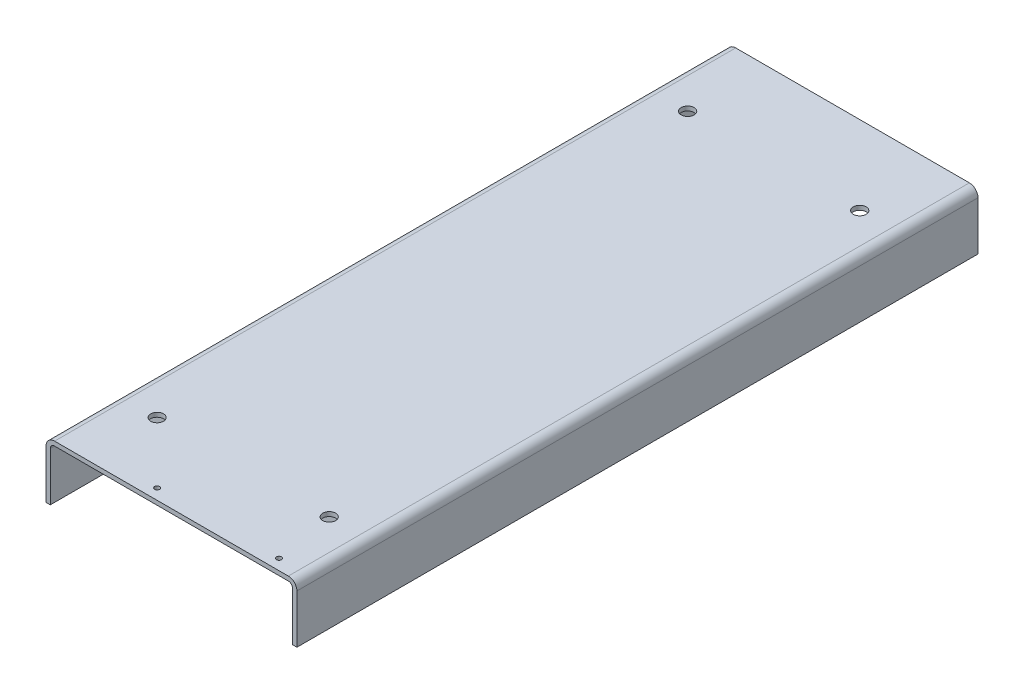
ISO-10303-21;
HEADER;
FILE_DESCRIPTION(('STEP AP214'),'2;1');
FILE_NAME('part.step','',(''),(''),'','','');
FILE_SCHEMA(('AUTOMOTIVE_DESIGN { 1 0 10303 214 1 1 1 1 }'));
ENDSEC;
DATA;
#1=APPLICATION_CONTEXT('core data for automotive mechanical design processes');
#2=APPLICATION_PROTOCOL_DEFINITION('international standard','automotive_design',2000,#1);
#3=PRODUCT_CONTEXT('',#1,'mechanical');
#4=PRODUCT('Part','Part','',(#3));
#5=PRODUCT_RELATED_PRODUCT_CATEGORY('part','',(#4));
#6=PRODUCT_DEFINITION_FORMATION('','',#4);
#7=PRODUCT_DEFINITION_CONTEXT('part definition',#1,'design');
#8=PRODUCT_DEFINITION('design','',#6,#7);
#9=PRODUCT_DEFINITION_SHAPE('','',#8);
#10=(LENGTH_UNIT() NAMED_UNIT(*) SI_UNIT(.MILLI.,.METRE.));
#11=(NAMED_UNIT(*) PLANE_ANGLE_UNIT() SI_UNIT($,.RADIAN.));
#12=(NAMED_UNIT(*) SI_UNIT($,.STERADIAN.) SOLID_ANGLE_UNIT());
#13=UNCERTAINTY_MEASURE_WITH_UNIT(LENGTH_MEASURE(1.E-05),#10,'distance_accuracy_value','');
#14=(GEOMETRIC_REPRESENTATION_CONTEXT(3) GLOBAL_UNCERTAINTY_ASSIGNED_CONTEXT((#13)) GLOBAL_UNIT_ASSIGNED_CONTEXT((#10,
#11,#12)) REPRESENTATION_CONTEXT('',''));
#15=CARTESIAN_POINT('',(0.,0.,0.));
#16=DIRECTION('',(0.,0.,1.));
#17=DIRECTION('',(1.,0.,0.));
#18=AXIS2_PLACEMENT_3D('',#15,#16,#17);
#19=CARTESIAN_POINT('',(-163.,74.,-950.));
#20=DIRECTION('',(0.,-1.,0.));
#21=DIRECTION('',(0.,0.,-1.));
#22=AXIS2_PLACEMENT_3D('',#19,#20,#21);
#23=PLANE('',#22);
#24=CARTESIAN_POINT('',(-120.,74.,-840.));
#25=DIRECTION('',(0.,1.,0.));
#26=DIRECTION('',(0.,0.,1.));
#27=AXIS2_PLACEMENT_3D('',#24,#25,#26);
#28=CIRCLE('',#27,9.00000000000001);
#29=CARTESIAN_POINT('',(-120.,74.,-831.));
#30=VERTEX_POINT('',#29);
#31=EDGE_CURVE('E352',#30,#30,#28,.T.);
#32=ORIENTED_EDGE('',*,*,#31,.T.);
#33=EDGE_LOOP('',(#32));
#34=FACE_BOUND('',#33,.T.);
#35=CARTESIAN_POINT('',(120.,74.,-840.));
#36=DIRECTION('',(0.,1.,0.));
#37=DIRECTION('',(0.,0.,1.));
#38=AXIS2_PLACEMENT_3D('',#35,#36,#37);
#39=CIRCLE('',#38,9.00000000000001);
#40=CARTESIAN_POINT('',(120.,74.,-831.));
#41=VERTEX_POINT('',#40);
#42=EDGE_CURVE('E358',#41,#41,#39,.T.);
#43=ORIENTED_EDGE('',*,*,#42,.T.);
#44=EDGE_LOOP('',(#43));
#45=FACE_BOUND('',#44,.T.);
#46=DIRECTION('',(0.,0.,1.));
#47=VECTOR('',#46,1.);
#48=CARTESIAN_POINT('',(163.,74.,-950.));
#49=LINE('',#48,#47);
#50=CARTESIAN_POINT('',(163.,74.,-950.));
#51=VERTEX_POINT('',#50);
#52=CARTESIAN_POINT('',(163.,74.,-813.));
#53=VERTEX_POINT('',#52);
#54=EDGE_CURVE('E532',#51,#53,#49,.T.);
#55=ORIENTED_EDGE('',*,*,#54,.T.);
#56=DIRECTION('',(-1.,0.,0.));
#57=VECTOR('',#56,1.);
#58=CARTESIAN_POINT('',(-163.,74.,-813.));
#59=LINE('',#58,#57);
#60=CARTESIAN_POINT('',(-163.,74.,-813.));
#61=VERTEX_POINT('',#60);
#62=EDGE_CURVE('E302',#53,#61,#59,.T.);
#63=ORIENTED_EDGE('',*,*,#62,.T.);
#64=DIRECTION('',(0.,0.,1.));
#65=VECTOR('',#64,1.);
#66=CARTESIAN_POINT('',(-163.,74.,-950.));
#67=LINE('',#66,#65);
#68=CARTESIAN_POINT('',(-163.,74.,-950.));
#69=VERTEX_POINT('',#68);
#70=EDGE_CURVE('E536',#69,#61,#67,.T.);
#71=ORIENTED_EDGE('',*,*,#70,.F.);
#72=DIRECTION('',(1.,0.,0.));
#73=VECTOR('',#72,1.);
#74=CARTESIAN_POINT('',(-163.,74.,-950.));
#75=LINE('',#74,#73);
#76=EDGE_CURVE('E492',#69,#51,#75,.T.);
#77=ORIENTED_EDGE('',*,*,#76,.T.);
#78=EDGE_LOOP('',(#55,#63,#71,#77));
#79=FACE_BOUND('',#78,.T.);
#80=ADVANCED_FACE('F32',(#34,#45,#79),#23,.T.);
#81=CARTESIAN_POINT('',(169.,68.,-950.));
#82=DIRECTION('',(-1.,0.,0.));
#83=DIRECTION('',(0.,0.,1.));
#84=AXIS2_PLACEMENT_3D('',#81,#82,#83);
#85=PLANE('',#84);
#86=DIRECTION('',(0.,0.,1.));
#87=VECTOR('',#86,1.);
#88=CARTESIAN_POINT('',(169.,0.,-950.));
#89=LINE('',#88,#87);
#90=CARTESIAN_POINT('',(169.,0.,-950.));
#91=VERTEX_POINT('',#90);
#92=CARTESIAN_POINT('',(169.,0.,-813.));
#93=VERTEX_POINT('',#92);
#94=EDGE_CURVE('E36',#91,#93,#89,.T.);
#95=ORIENTED_EDGE('',*,*,#94,.T.);
#96=DIRECTION('',(0.,1.,0.));
#97=VECTOR('',#96,1.);
#98=CARTESIAN_POINT('',(169.,68.,-813.));
#99=LINE('',#98,#97);
#100=CARTESIAN_POINT('',(169.,68.,-813.));
#101=VERTEX_POINT('',#100);
#102=EDGE_CURVE('E305',#93,#101,#99,.T.);
#103=ORIENTED_EDGE('',*,*,#102,.T.);
#104=DIRECTION('',(0.,0.,1.));
#105=VECTOR('',#104,1.);
#106=CARTESIAN_POINT('',(169.,68.,-950.));
#107=LINE('',#106,#105);
#108=CARTESIAN_POINT('',(169.,68.,-950.));
#109=VERTEX_POINT('',#108);
#110=EDGE_CURVE('E11',#109,#101,#107,.T.);
#111=ORIENTED_EDGE('',*,*,#110,.F.);
#112=DIRECTION('',(0.,1.,0.));
#113=VECTOR('',#112,1.);
#114=CARTESIAN_POINT('',(169.,68.,-950.));
#115=LINE('',#114,#113);
#116=EDGE_CURVE('E468',#109,#91,#115,.F.);
#117=ORIENTED_EDGE('',*,*,#116,.T.);
#118=EDGE_LOOP('',(#95,#103,#111,#117));
#119=FACE_BOUND('',#118,.T.);
#120=ADVANCED_FACE('F626',(#119),#85,.T.);
#121=CARTESIAN_POINT('',(163.,68.,-950.));
#122=DIRECTION('',(0.,0.,1.));
#123=DIRECTION('',(1.,0.,0.));
#124=AXIS2_PLACEMENT_3D('',#121,#122,#123);
#125=CYLINDRICAL_SURFACE('',#124,6.);
#126=ORIENTED_EDGE('',*,*,#110,.T.);
#127=CARTESIAN_POINT('',(163.,68.,-813.));
#128=DIRECTION('',(0.,0.,1.));
#129=DIRECTION('',(1.,0.,0.));
#130=AXIS2_PLACEMENT_3D('',#127,#128,#129);
#131=CIRCLE('',#130,6.);
#132=EDGE_CURVE('E57',#101,#53,#131,.T.);
#133=ORIENTED_EDGE('',*,*,#132,.T.);
#134=ORIENTED_EDGE('',*,*,#54,.F.);
#135=CARTESIAN_POINT('',(163.,68.,-950.));
#136=DIRECTION('',(0.,0.,1.));
#137=DIRECTION('',(1.,0.,0.));
#138=AXIS2_PLACEMENT_3D('',#135,#136,#137);
#139=CIRCLE('',#138,6.);
#140=EDGE_CURVE('E495',#51,#109,#139,.F.);
#141=ORIENTED_EDGE('',*,*,#140,.T.);
#142=EDGE_LOOP('',(#126,#133,#134,#141));
#143=FACE_BOUND('',#142,.T.);
#144=ADVANCED_FACE('F631',(#143),#125,.F.);
#145=CARTESIAN_POINT('',(-163.,68.,-950.));
#146=DIRECTION('',(0.,0.,1.));
#147=DIRECTION('',(1.,0.,0.));
#148=AXIS2_PLACEMENT_3D('',#145,#146,#147);
#149=CYLINDRICAL_SURFACE('',#148,5.99999999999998);
#150=ORIENTED_EDGE('',*,*,#70,.T.);
#151=CARTESIAN_POINT('',(-163.,68.,-813.));
#152=DIRECTION('',(0.,0.,1.));
#153=DIRECTION('',(1.,0.,0.));
#154=AXIS2_PLACEMENT_3D('',#151,#152,#153);
#155=CIRCLE('',#154,5.99999999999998);
#156=CARTESIAN_POINT('',(-169.,68.,-813.));
#157=VERTEX_POINT('',#156);
#158=EDGE_CURVE('E296',#61,#157,#155,.T.);
#159=ORIENTED_EDGE('',*,*,#158,.T.);
#160=DIRECTION('',(0.,0.,1.));
#161=VECTOR('',#160,1.);
#162=CARTESIAN_POINT('',(-169.,68.,-950.));
#163=LINE('',#162,#161);
#164=CARTESIAN_POINT('',(-169.,68.,-950.));
#165=VERTEX_POINT('',#164);
#166=EDGE_CURVE('E541',#165,#157,#163,.T.);
#167=ORIENTED_EDGE('',*,*,#166,.F.);
#168=CARTESIAN_POINT('',(-163.,68.,-950.));
#169=DIRECTION('',(0.,0.,1.));
#170=DIRECTION('',(1.,0.,0.));
#171=AXIS2_PLACEMENT_3D('',#168,#169,#170);
#172=CIRCLE('',#171,5.99999999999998);
#173=EDGE_CURVE('E489',#165,#69,#172,.F.);
#174=ORIENTED_EDGE('',*,*,#173,.T.);
#175=EDGE_LOOP('',(#150,#159,#167,#174));
#176=FACE_BOUND('',#175,.T.);
#177=ADVANCED_FACE('F620',(#176),#149,.F.);
#178=CARTESIAN_POINT('',(-169.,0.,-950.));
#179=DIRECTION('',(1.,0.,0.));
#180=DIRECTION('',(0.,1.,0.));
#181=AXIS2_PLACEMENT_3D('',#178,#179,#180);
#182=PLANE('',#181);
#183=ORIENTED_EDGE('',*,*,#166,.T.);
#184=DIRECTION('',(0.,-1.,0.));
#185=VECTOR('',#184,1.);
#186=CARTESIAN_POINT('',(-169.,0.,-813.));
#187=LINE('',#186,#185);
#188=CARTESIAN_POINT('',(-169.,0.,-813.));
#189=VERTEX_POINT('',#188);
#190=EDGE_CURVE('E293',#157,#189,#187,.T.);
#191=ORIENTED_EDGE('',*,*,#190,.T.);
#192=DIRECTION('',(0.,0.,1.));
#193=VECTOR('',#192,1.);
#194=CARTESIAN_POINT('',(-169.,0.,-950.));
#195=LINE('',#194,#193);
#196=CARTESIAN_POINT('',(-169.,0.,-950.));
#197=VERTEX_POINT('',#196);
#198=EDGE_CURVE('E546',#197,#189,#195,.T.);
#199=ORIENTED_EDGE('',*,*,#198,.F.);
#200=DIRECTION('',(0.,1.,0.));
#201=VECTOR('',#200,1.);
#202=CARTESIAN_POINT('',(-169.,0.,-950.));
#203=LINE('',#202,#201);
#204=EDGE_CURVE('E486',#197,#165,#203,.T.);
#205=ORIENTED_EDGE('',*,*,#204,.T.);
#206=EDGE_LOOP('',(#183,#191,#199,#205));
#207=FACE_BOUND('',#206,.T.);
#208=ADVANCED_FACE('F613',(#207),#182,.T.);
#209=DIRECTION('',(-1.,0.,0.));
#210=VECTOR('',#209,1.);
#211=CARTESIAN_POINT('',(-163.,74.,-807.));
#212=LINE('',#211,#210);
#213=CARTESIAN_POINT('',(163.,74.,-807.));
#214=VERTEX_POINT('',#213);
#215=CARTESIAN_POINT('',(-163.,74.,-807.));
#216=VERTEX_POINT('',#215);
#217=EDGE_CURVE('E50',#214,#216,#212,.T.);
#218=ORIENTED_EDGE('',*,*,#217,.F.);
#219=CARTESIAN_POINT('',(163.,74.,-143.));
#220=VERTEX_POINT('',#219);
#221=EDGE_CURVE('E534',#214,#220,#49,.T.);
#222=ORIENTED_EDGE('',*,*,#221,.T.);
#223=DIRECTION('',(-1.,0.,0.));
#224=VECTOR('',#223,1.);
#225=CARTESIAN_POINT('',(-163.,74.,-143.));
#226=LINE('',#225,#224);
#227=CARTESIAN_POINT('',(-163.,74.,-143.));
#228=VERTEX_POINT('',#227);
#229=EDGE_CURVE('E322',#220,#228,#226,.T.);
#230=ORIENTED_EDGE('',*,*,#229,.T.);
#231=EDGE_CURVE('E539',#216,#228,#67,.T.);
#232=ORIENTED_EDGE('',*,*,#231,.F.);
#233=EDGE_LOOP('',(#218,#222,#230,#232));
#234=FACE_BOUND('',#233,.T.);
#235=ADVANCED_FACE('F588',(#234),#23,.T.);
#236=DIRECTION('',(0.,1.,0.));
#237=VECTOR('',#236,1.);
#238=CARTESIAN_POINT('',(169.,68.,-807.));
#239=LINE('',#238,#237);
#240=CARTESIAN_POINT('',(169.,0.,-807.));
#241=VERTEX_POINT('',#240);
#242=CARTESIAN_POINT('',(169.,68.,-807.));
#243=VERTEX_POINT('',#242);
#244=EDGE_CURVE('E283',#241,#243,#239,.T.);
#245=ORIENTED_EDGE('',*,*,#244,.F.);
#246=CARTESIAN_POINT('',(169.,0.,-143.));
#247=VERTEX_POINT('',#246);
#248=EDGE_CURVE('E269',#241,#247,#89,.T.);
#249=ORIENTED_EDGE('',*,*,#248,.T.);
#250=DIRECTION('',(0.,1.,0.));
#251=VECTOR('',#250,1.);
#252=CARTESIAN_POINT('',(169.,68.,-143.));
#253=LINE('',#252,#251);
#254=CARTESIAN_POINT('',(169.,68.,-143.));
#255=VERTEX_POINT('',#254);
#256=EDGE_CURVE('E328',#247,#255,#253,.T.);
#257=ORIENTED_EDGE('',*,*,#256,.T.);
#258=EDGE_CURVE('E41',#243,#255,#107,.T.);
#259=ORIENTED_EDGE('',*,*,#258,.F.);
#260=EDGE_LOOP('',(#245,#249,#257,#259));
#261=FACE_BOUND('',#260,.T.);
#262=ADVANCED_FACE('F284',(#261),#85,.T.);
#263=CARTESIAN_POINT('',(163.,68.,-807.));
#264=DIRECTION('',(0.,0.,1.));
#265=DIRECTION('',(1.,0.,0.));
#266=AXIS2_PLACEMENT_3D('',#263,#264,#265);
#267=CIRCLE('',#266,6.);
#268=EDGE_CURVE('E287',#243,#214,#267,.T.);
#269=ORIENTED_EDGE('',*,*,#268,.F.);
#270=ORIENTED_EDGE('',*,*,#258,.T.);
#271=CARTESIAN_POINT('',(163.,68.,-143.));
#272=DIRECTION('',(0.,0.,1.));
#273=DIRECTION('',(1.,0.,0.));
#274=AXIS2_PLACEMENT_3D('',#271,#272,#273);
#275=CIRCLE('',#274,6.);
#276=EDGE_CURVE('E325',#255,#220,#275,.T.);
#277=ORIENTED_EDGE('',*,*,#276,.T.);
#278=ORIENTED_EDGE('',*,*,#221,.F.);
#279=EDGE_LOOP('',(#269,#270,#277,#278));
#280=FACE_BOUND('',#279,.T.);
#281=ADVANCED_FACE('F581',(#280),#125,.F.);
#282=CARTESIAN_POINT('',(-163.,68.,-807.));
#283=DIRECTION('',(0.,0.,1.));
#284=DIRECTION('',(1.,0.,0.));
#285=AXIS2_PLACEMENT_3D('',#282,#283,#284);
#286=CIRCLE('',#285,5.99999999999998);
#287=CARTESIAN_POINT('',(-169.,68.,-807.));
#288=VERTEX_POINT('',#287);
#289=EDGE_CURVE('E308',#216,#288,#286,.T.);
#290=ORIENTED_EDGE('',*,*,#289,.F.);
#291=ORIENTED_EDGE('',*,*,#231,.T.);
#292=CARTESIAN_POINT('',(-163.,68.,-143.));
#293=DIRECTION('',(0.,0.,1.));
#294=DIRECTION('',(1.,0.,0.));
#295=AXIS2_PLACEMENT_3D('',#292,#293,#294);
#296=CIRCLE('',#295,5.99999999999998);
#297=CARTESIAN_POINT('',(-169.,68.,-143.));
#298=VERTEX_POINT('',#297);
#299=EDGE_CURVE('E319',#228,#298,#296,.T.);
#300=ORIENTED_EDGE('',*,*,#299,.T.);
#301=EDGE_CURVE('E544',#288,#298,#163,.T.);
#302=ORIENTED_EDGE('',*,*,#301,.F.);
#303=EDGE_LOOP('',(#290,#291,#300,#302));
#304=FACE_BOUND('',#303,.T.);
#305=ADVANCED_FACE('F607',(#304),#149,.F.);
#306=DIRECTION('',(0.,-1.,0.));
#307=VECTOR('',#306,1.);
#308=CARTESIAN_POINT('',(-169.,0.,-807.));
#309=LINE('',#308,#307);
#310=CARTESIAN_POINT('',(-169.,0.,-807.));
#311=VERTEX_POINT('',#310);
#312=EDGE_CURVE('E292',#288,#311,#309,.T.);
#313=ORIENTED_EDGE('',*,*,#312,.F.);
#314=ORIENTED_EDGE('',*,*,#301,.T.);
#315=DIRECTION('',(0.,-1.,0.));
#316=VECTOR('',#315,1.);
#317=CARTESIAN_POINT('',(-169.,0.,-143.));
#318=LINE('',#317,#316);
#319=CARTESIAN_POINT('',(-169.,0.,-143.));
#320=VERTEX_POINT('',#319);
#321=EDGE_CURVE('E315',#298,#320,#318,.T.);
#322=ORIENTED_EDGE('',*,*,#321,.T.);
#323=EDGE_CURVE('E549',#311,#320,#195,.T.);
#324=ORIENTED_EDGE('',*,*,#323,.F.);
#325=EDGE_LOOP('',(#313,#314,#322,#324));
#326=FACE_BOUND('',#325,.T.);
#327=ADVANCED_FACE('F610',(#326),#182,.T.);
#328=DIRECTION('',(-1.,0.,0.));
#329=VECTOR('',#328,1.);
#330=CARTESIAN_POINT('',(-163.,74.,-137.));
#331=LINE('',#330,#329);
#332=CARTESIAN_POINT('',(163.,74.,-137.));
#333=VERTEX_POINT('',#332);
#334=CARTESIAN_POINT('',(-163.,74.,-137.));
#335=VERTEX_POINT('',#334);
#336=EDGE_CURVE('E336',#333,#335,#331,.T.);
#337=ORIENTED_EDGE('',*,*,#336,.F.);
#338=CARTESIAN_POINT('',(163.,74.,0.));
#339=VERTEX_POINT('',#338);
#340=EDGE_CURVE('E535',#333,#339,#49,.T.);
#341=ORIENTED_EDGE('',*,*,#340,.T.);
#342=DIRECTION('',(1.,0.,0.));
#343=VECTOR('',#342,1.);
#344=CARTESIAN_POINT('',(-163.,74.,0.));
#345=LINE('',#344,#343);
#346=CARTESIAN_POINT('',(-163.,74.,0.));
#347=VERTEX_POINT('',#346);
#348=EDGE_CURVE('E527',#347,#339,#345,.T.);
#349=ORIENTED_EDGE('',*,*,#348,.F.);
#350=EDGE_CURVE('E540',#335,#347,#67,.T.);
#351=ORIENTED_EDGE('',*,*,#350,.F.);
#352=EDGE_LOOP('',(#337,#341,#349,#351));
#353=FACE_BOUND('',#352,.T.);
#354=CARTESIAN_POINT('',(-120.,74.,-100.));
#355=DIRECTION('',(0.,1.,0.));
#356=DIRECTION('',(0.,0.,1.));
#357=AXIS2_PLACEMENT_3D('',#354,#355,#356);
#358=CIRCLE('',#357,9.00000000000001);
#359=CARTESIAN_POINT('',(-120.,74.,-91.0000000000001));
#360=VERTEX_POINT('',#359);
#361=EDGE_CURVE('E346',#360,#360,#358,.T.);
#362=ORIENTED_EDGE('',*,*,#361,.T.);
#363=EDGE_LOOP('',(#362));
#364=FACE_BOUND('',#363,.T.);
#365=CARTESIAN_POINT('',(120.,74.,-100.));
#366=DIRECTION('',(0.,1.,0.));
#367=DIRECTION('',(0.,0.,1.));
#368=AXIS2_PLACEMENT_3D('',#365,#366,#367);
#369=CIRCLE('',#368,8.99999999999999);
#370=CARTESIAN_POINT('',(120.,74.,-91.0000000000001));
#371=VERTEX_POINT('',#370);
#372=EDGE_CURVE('E364',#371,#371,#369,.T.);
#373=ORIENTED_EDGE('',*,*,#372,.T.);
#374=EDGE_LOOP('',(#373));
#375=FACE_BOUND('',#374,.T.);
#376=DIRECTION('',(-0.499999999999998,0.,0.86602540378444));
#377=VECTOR('',#376,1.);
#378=CARTESIAN_POINT('',(142.505553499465,74.,-15.));
#379=LINE('',#378,#377);
#380=CARTESIAN_POINT('',(142.505553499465,74.,-15.));
#381=VERTEX_POINT('',#380);
#382=CARTESIAN_POINT('',(138.752776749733,74.,-8.50000000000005));
#383=VERTEX_POINT('',#382);
#384=EDGE_CURVE('E436',#381,#383,#379,.T.);
#385=ORIENTED_EDGE('',*,*,#384,.F.);
#386=DIRECTION('',(0.5,0.,0.866025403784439));
#387=VECTOR('',#386,1.);
#388=CARTESIAN_POINT('',(138.752776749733,74.,-21.5));
#389=LINE('',#388,#387);
#390=CARTESIAN_POINT('',(138.752776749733,74.,-21.5));
#391=VERTEX_POINT('',#390);
#392=EDGE_CURVE('E418',#391,#381,#389,.T.);
#393=ORIENTED_EDGE('',*,*,#392,.F.);
#394=DIRECTION('',(1.,0.,0.));
#395=VECTOR('',#394,1.);
#396=CARTESIAN_POINT('',(131.247223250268,74.,-21.5));
#397=LINE('',#396,#395);
#398=CARTESIAN_POINT('',(131.247223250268,74.,-21.5000000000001));
#399=VERTEX_POINT('',#398);
#400=EDGE_CURVE('E423',#399,#391,#397,.T.);
#401=ORIENTED_EDGE('',*,*,#400,.F.);
#402=DIRECTION('',(0.499999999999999,0.,-0.866025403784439));
#403=VECTOR('',#402,1.);
#404=CARTESIAN_POINT('',(127.494446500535,74.,-15.));
#405=LINE('',#404,#403);
#406=CARTESIAN_POINT('',(127.494446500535,74.,-15.));
#407=VERTEX_POINT('',#406);
#408=EDGE_CURVE('E442',#407,#399,#405,.T.);
#409=ORIENTED_EDGE('',*,*,#408,.F.);
#410=DIRECTION('',(-0.499999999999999,0.,-0.866025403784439));
#411=VECTOR('',#410,1.);
#412=CARTESIAN_POINT('',(131.247223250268,74.,-8.50000000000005));
#413=LINE('',#412,#411);
#414=CARTESIAN_POINT('',(131.247223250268,74.,-8.50000000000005));
#415=VERTEX_POINT('',#414);
#416=EDGE_CURVE('E440',#415,#407,#413,.T.);
#417=ORIENTED_EDGE('',*,*,#416,.F.);
#418=DIRECTION('',(-1.,0.,0.));
#419=VECTOR('',#418,1.);
#420=CARTESIAN_POINT('',(138.752776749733,74.,-8.50000000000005));
#421=LINE('',#420,#419);
#422=EDGE_CURVE('E438',#383,#415,#421,.T.);
#423=ORIENTED_EDGE('',*,*,#422,.F.);
#424=EDGE_LOOP('',(#385,#393,#401,#409,#417,#423));
#425=FACE_BOUND('',#424,.T.);
#426=DIRECTION('',(-0.5,0.,0.866025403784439));
#427=VECTOR('',#426,1.);
#428=CARTESIAN_POINT('',(-27.4944465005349,74.,-15.));
#429=LINE('',#428,#427);
#430=CARTESIAN_POINT('',(-27.4944465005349,74.,-15.));
#431=VERTEX_POINT('',#430);
#432=CARTESIAN_POINT('',(-31.2472232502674,74.,-8.49999999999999));
#433=VERTEX_POINT('',#432);
#434=EDGE_CURVE('E390',#431,#433,#429,.T.);
#435=ORIENTED_EDGE('',*,*,#434,.F.);
#436=DIRECTION('',(0.5,0.,0.866025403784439));
#437=VECTOR('',#436,1.);
#438=CARTESIAN_POINT('',(-31.2472232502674,74.,-21.5));
#439=LINE('',#438,#437);
#440=CARTESIAN_POINT('',(-31.2472232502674,74.,-21.5));
#441=VERTEX_POINT('',#440);
#442=EDGE_CURVE('E372',#441,#431,#439,.T.);
#443=ORIENTED_EDGE('',*,*,#442,.F.);
#444=DIRECTION('',(1.,0.,0.));
#445=VECTOR('',#444,1.);
#446=CARTESIAN_POINT('',(-38.7527767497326,74.,-21.5));
#447=LINE('',#446,#445);
#448=CARTESIAN_POINT('',(-38.7527767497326,74.,-21.5));
#449=VERTEX_POINT('',#448);
#450=EDGE_CURVE('E377',#449,#441,#447,.T.);
#451=ORIENTED_EDGE('',*,*,#450,.F.);
#452=DIRECTION('',(0.5,0.,-0.866025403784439));
#453=VECTOR('',#452,1.);
#454=CARTESIAN_POINT('',(-42.5055534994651,74.,-15.));
#455=LINE('',#454,#453);
#456=CARTESIAN_POINT('',(-42.5055534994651,74.,-15.));
#457=VERTEX_POINT('',#456);
#458=EDGE_CURVE('E396',#457,#449,#455,.T.);
#459=ORIENTED_EDGE('',*,*,#458,.F.);
#460=DIRECTION('',(-0.5,0.,-0.866025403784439));
#461=VECTOR('',#460,1.);
#462=CARTESIAN_POINT('',(-38.7527767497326,74.,-8.49999999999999));
#463=LINE('',#462,#461);
#464=CARTESIAN_POINT('',(-38.7527767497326,74.,-8.49999999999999));
#465=VERTEX_POINT('',#464);
#466=EDGE_CURVE('E394',#465,#457,#463,.T.);
#467=ORIENTED_EDGE('',*,*,#466,.F.);
#468=DIRECTION('',(-1.,0.,0.));
#469=VECTOR('',#468,1.);
#470=CARTESIAN_POINT('',(-31.2472232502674,74.,-8.49999999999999));
#471=LINE('',#470,#469);
#472=EDGE_CURVE('E392',#433,#465,#471,.T.);
#473=ORIENTED_EDGE('',*,*,#472,.F.);
#474=EDGE_LOOP('',(#435,#443,#451,#459,#467,#473));
#475=FACE_BOUND('',#474,.T.);
#476=ADVANCED_FACE('F590',(#353,#364,#375,#425,#475),#23,.T.);
#477=DIRECTION('',(0.,1.,0.));
#478=VECTOR('',#477,1.);
#479=CARTESIAN_POINT('',(169.,68.,-137.));
#480=LINE('',#479,#478);
#481=CARTESIAN_POINT('',(169.,0.,-137.));
#482=VERTEX_POINT('',#481);
#483=CARTESIAN_POINT('',(169.,68.,-137.));
#484=VERTEX_POINT('',#483);
#485=EDGE_CURVE('E342',#482,#484,#480,.T.);
#486=ORIENTED_EDGE('',*,*,#485,.F.);
#487=CARTESIAN_POINT('',(169.,0.,0.));
#488=VERTEX_POINT('',#487);
#489=EDGE_CURVE('E280',#482,#488,#89,.T.);
#490=ORIENTED_EDGE('',*,*,#489,.T.);
#491=DIRECTION('',(0.,1.,0.));
#492=VECTOR('',#491,1.);
#493=CARTESIAN_POINT('',(169.,68.,0.));
#494=LINE('',#493,#492);
#495=CARTESIAN_POINT('',(169.,68.,0.));
#496=VERTEX_POINT('',#495);
#497=EDGE_CURVE('E467',#496,#488,#494,.F.);
#498=ORIENTED_EDGE('',*,*,#497,.F.);
#499=EDGE_CURVE('E43',#484,#496,#107,.T.);
#500=ORIENTED_EDGE('',*,*,#499,.F.);
#501=EDGE_LOOP('',(#486,#490,#498,#500));
#502=FACE_BOUND('',#501,.T.);
#503=ADVANCED_FACE('F34',(#502),#85,.T.);
#504=CARTESIAN_POINT('',(163.,68.,-137.));
#505=DIRECTION('',(0.,0.,1.));
#506=DIRECTION('',(1.,0.,0.));
#507=AXIS2_PLACEMENT_3D('',#504,#505,#506);
#508=CIRCLE('',#507,6.);
#509=EDGE_CURVE('E339',#484,#333,#508,.T.);
#510=ORIENTED_EDGE('',*,*,#509,.F.);
#511=ORIENTED_EDGE('',*,*,#499,.T.);
#512=CARTESIAN_POINT('',(163.,68.,0.));
#513=DIRECTION('',(0.,0.,1.));
#514=DIRECTION('',(1.,0.,0.));
#515=AXIS2_PLACEMENT_3D('',#512,#513,#514);
#516=CIRCLE('',#515,6.);
#517=EDGE_CURVE('E472',#339,#496,#516,.F.);
#518=ORIENTED_EDGE('',*,*,#517,.F.);
#519=ORIENTED_EDGE('',*,*,#340,.F.);
#520=EDGE_LOOP('',(#510,#511,#518,#519));
#521=FACE_BOUND('',#520,.T.);
#522=ADVANCED_FACE('F579',(#521),#125,.F.);
#523=CARTESIAN_POINT('',(-163.,68.,-137.));
#524=DIRECTION('',(0.,0.,1.));
#525=DIRECTION('',(1.,0.,0.));
#526=AXIS2_PLACEMENT_3D('',#523,#524,#525);
#527=CIRCLE('',#526,5.99999999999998);
#528=CARTESIAN_POINT('',(-169.,68.,-137.));
#529=VERTEX_POINT('',#528);
#530=EDGE_CURVE('E333',#335,#529,#527,.T.);
#531=ORIENTED_EDGE('',*,*,#530,.F.);
#532=ORIENTED_EDGE('',*,*,#350,.T.);
#533=CARTESIAN_POINT('',(-163.,68.,0.));
#534=DIRECTION('',(0.,0.,1.));
#535=DIRECTION('',(1.,0.,0.));
#536=AXIS2_PLACEMENT_3D('',#533,#534,#535);
#537=CIRCLE('',#536,5.99999999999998);
#538=CARTESIAN_POINT('',(-169.,68.,0.));
#539=VERTEX_POINT('',#538);
#540=EDGE_CURVE('E524',#539,#347,#537,.F.);
#541=ORIENTED_EDGE('',*,*,#540,.F.);
#542=EDGE_CURVE('E545',#529,#539,#163,.T.);
#543=ORIENTED_EDGE('',*,*,#542,.F.);
#544=EDGE_LOOP('',(#531,#532,#541,#543));
#545=FACE_BOUND('',#544,.T.);
#546=ADVANCED_FACE('F605',(#545),#149,.F.);
#547=DIRECTION('',(0.,-1.,0.));
#548=VECTOR('',#547,1.);
#549=CARTESIAN_POINT('',(-169.,0.,-137.));
#550=LINE('',#549,#548);
#551=CARTESIAN_POINT('',(-169.,0.,-137.));
#552=VERTEX_POINT('',#551);
#553=EDGE_CURVE('E330',#529,#552,#550,.T.);
#554=ORIENTED_EDGE('',*,*,#553,.F.);
#555=ORIENTED_EDGE('',*,*,#542,.T.);
#556=DIRECTION('',(0.,1.,0.));
#557=VECTOR('',#556,1.);
#558=CARTESIAN_POINT('',(-169.,0.,0.));
#559=LINE('',#558,#557);
#560=CARTESIAN_POINT('',(-169.,0.,0.));
#561=VERTEX_POINT('',#560);
#562=EDGE_CURVE('E521',#561,#539,#559,.T.);
#563=ORIENTED_EDGE('',*,*,#562,.F.);
#564=EDGE_CURVE('E550',#552,#561,#195,.T.);
#565=ORIENTED_EDGE('',*,*,#564,.F.);
#566=EDGE_LOOP('',(#554,#555,#563,#565));
#567=FACE_BOUND('',#566,.T.);
#568=ADVANCED_FACE('F601',(#567),#182,.T.);
#569=CARTESIAN_POINT('',(-169.,0.,-950.));
#570=DIRECTION('',(0.,1.,0.));
#571=DIRECTION('',(-1.,0.,0.));
#572=AXIS2_PLACEMENT_3D('',#569,#570,#571);
#573=PLANE('',#572);
#574=DIRECTION('',(1.,0.,0.));
#575=VECTOR('',#574,1.);
#576=CARTESIAN_POINT('',(0.,0.,-807.));
#577=LINE('',#576,#575);
#578=EDGE_CURVE('E274',#311,#241,#577,.T.);
#579=ORIENTED_EDGE('',*,*,#578,.F.);
#580=ORIENTED_EDGE('',*,*,#323,.T.);
#581=DIRECTION('',(1.,0.,0.));
#582=VECTOR('',#581,1.);
#583=CARTESIAN_POINT('',(0.,0.,-143.));
#584=LINE('',#583,#582);
#585=EDGE_CURVE('E276',#320,#247,#584,.T.);
#586=ORIENTED_EDGE('',*,*,#585,.T.);
#587=ORIENTED_EDGE('',*,*,#248,.F.);
#588=EDGE_LOOP('',(#579,#580,#586,#587));
#589=FACE_BOUND('',#588,.T.);
#590=DIRECTION('',(-1.,0.,0.));
#591=VECTOR('',#590,1.);
#592=CARTESIAN_POINT('',(-169.,0.,0.));
#593=LINE('',#592,#591);
#594=CARTESIAN_POINT('',(-175.,0.,0.));
#595=VERTEX_POINT('',#594);
#596=EDGE_CURVE('E518',#561,#595,#593,.T.);
#597=ORIENTED_EDGE('',*,*,#596,.T.);
#598=DIRECTION('',(0.,0.,1.));
#599=VECTOR('',#598,1.);
#600=CARTESIAN_POINT('',(-175.,0.,-950.));
#601=LINE('',#600,#599);
#602=CARTESIAN_POINT('',(-175.,0.,-950.));
#603=VERTEX_POINT('',#602);
#604=EDGE_CURVE('E551',#603,#595,#601,.T.);
#605=ORIENTED_EDGE('',*,*,#604,.F.);
#606=DIRECTION('',(-1.,0.,0.));
#607=VECTOR('',#606,1.);
#608=CARTESIAN_POINT('',(-169.,0.,-950.));
#609=LINE('',#608,#607);
#610=EDGE_CURVE('E484',#197,#603,#609,.T.);
#611=ORIENTED_EDGE('',*,*,#610,.F.);
#612=ORIENTED_EDGE('',*,*,#198,.T.);
#613=DIRECTION('',(1.,0.,0.));
#614=VECTOR('',#613,1.);
#615=CARTESIAN_POINT('',(0.,0.,-813.));
#616=LINE('',#615,#614);
#617=EDGE_CURVE('E294',#189,#93,#616,.T.);
#618=ORIENTED_EDGE('',*,*,#617,.T.);
#619=ORIENTED_EDGE('',*,*,#94,.F.);
#620=DIRECTION('',(-1.,0.,0.));
#621=VECTOR('',#620,1.);
#622=CARTESIAN_POINT('',(175.,0.,-950.));
#623=LINE('',#622,#621);
#624=CARTESIAN_POINT('',(175.,0.,-950.));
#625=VERTEX_POINT('',#624);
#626=EDGE_CURVE('E471',#625,#91,#623,.T.);
#627=ORIENTED_EDGE('',*,*,#626,.F.);
#628=DIRECTION('',(0.,0.,1.));
#629=VECTOR('',#628,1.);
#630=CARTESIAN_POINT('',(175.,0.,-950.));
#631=LINE('',#630,#629);
#632=CARTESIAN_POINT('',(175.,0.,0.));
#633=VERTEX_POINT('',#632);
#634=EDGE_CURVE('E560',#625,#633,#631,.T.);
#635=ORIENTED_EDGE('',*,*,#634,.T.);
#636=DIRECTION('',(-1.,0.,0.));
#637=VECTOR('',#636,1.);
#638=CARTESIAN_POINT('',(175.,0.,0.));
#639=LINE('',#638,#637);
#640=EDGE_CURVE('E500',#633,#488,#639,.T.);
#641=ORIENTED_EDGE('',*,*,#640,.T.);
#642=ORIENTED_EDGE('',*,*,#489,.F.);
#643=DIRECTION('',(1.,0.,0.));
#644=VECTOR('',#643,1.);
#645=CARTESIAN_POINT('',(0.,0.,-137.));
#646=LINE('',#645,#644);
#647=EDGE_CURVE('E312',#552,#482,#646,.T.);
#648=ORIENTED_EDGE('',*,*,#647,.F.);
#649=ORIENTED_EDGE('',*,*,#564,.T.);
#650=EDGE_LOOP('',(#597,#605,#611,#612,#618,#619,#627,#635,#641,#642,#648,#649));
#651=FACE_BOUND('',#650,.T.);
#652=ADVANCED_FACE('F271',(#589,#651),#573,.F.);
#653=CARTESIAN_POINT('',(-175.,0.,-950.));
#654=DIRECTION('',(1.,0.,0.));
#655=DIRECTION('',(0.,1.,0.));
#656=AXIS2_PLACEMENT_3D('',#653,#654,#655);
#657=PLANE('',#656);
#658=DIRECTION('',(0.,1.,0.));
#659=VECTOR('',#658,1.);
#660=CARTESIAN_POINT('',(-175.,0.,0.));
#661=LINE('',#660,#659);
#662=CARTESIAN_POINT('',(-175.,68.,0.));
#663=VERTEX_POINT('',#662);
#664=EDGE_CURVE('E515',#595,#663,#661,.T.);
#665=ORIENTED_EDGE('',*,*,#664,.T.);
#666=DIRECTION('',(0.,0.,1.));
#667=VECTOR('',#666,1.);
#668=CARTESIAN_POINT('',(-175.,68.,-950.));
#669=LINE('',#668,#667);
#670=CARTESIAN_POINT('',(-175.,68.,-950.));
#671=VERTEX_POINT('',#670);
#672=EDGE_CURVE('E553',#671,#663,#669,.T.);
#673=ORIENTED_EDGE('',*,*,#672,.F.);
#674=DIRECTION('',(0.,1.,0.));
#675=VECTOR('',#674,1.);
#676=CARTESIAN_POINT('',(-175.,0.,-950.));
#677=LINE('',#676,#675);
#678=EDGE_CURVE('E482',#603,#671,#677,.T.);
#679=ORIENTED_EDGE('',*,*,#678,.F.);
#680=ORIENTED_EDGE('',*,*,#604,.T.);
#681=EDGE_LOOP('',(#665,#673,#679,#680));
#682=FACE_BOUND('',#681,.T.);
#683=ADVANCED_FACE('F674',(#682),#657,.F.);
#684=CARTESIAN_POINT('',(-163.,68.,-950.));
#685=DIRECTION('',(0.,0.,1.));
#686=DIRECTION('',(1.,0.,0.));
#687=AXIS2_PLACEMENT_3D('',#684,#685,#686);
#688=CYLINDRICAL_SURFACE('',#687,12.);
#689=CARTESIAN_POINT('',(-163.,68.,0.));
#690=DIRECTION('',(0.,0.,-1.));
#691=DIRECTION('',(-1.,0.,0.));
#692=AXIS2_PLACEMENT_3D('',#689,#690,#691);
#693=CIRCLE('',#692,12.);
#694=CARTESIAN_POINT('',(-163.,80.,0.));
#695=VERTEX_POINT('',#694);
#696=EDGE_CURVE('E512',#663,#695,#693,.T.);
#697=ORIENTED_EDGE('',*,*,#696,.T.);
#698=DIRECTION('',(0.,0.,1.));
#699=VECTOR('',#698,1.);
#700=CARTESIAN_POINT('',(-163.,80.,-950.));
#701=LINE('',#700,#699);
#702=CARTESIAN_POINT('',(-163.,80.,-950.));
#703=VERTEX_POINT('',#702);
#704=EDGE_CURVE('E555',#703,#695,#701,.T.);
#705=ORIENTED_EDGE('',*,*,#704,.F.);
#706=CARTESIAN_POINT('',(-163.,68.,-950.));
#707=DIRECTION('',(0.,0.,-1.));
#708=DIRECTION('',(-1.,0.,0.));
#709=AXIS2_PLACEMENT_3D('',#706,#707,#708);
#710=CIRCLE('',#709,12.);
#711=EDGE_CURVE('E480',#671,#703,#710,.T.);
#712=ORIENTED_EDGE('',*,*,#711,.F.);
#713=ORIENTED_EDGE('',*,*,#672,.T.);
#714=EDGE_LOOP('',(#697,#705,#712,#713));
#715=FACE_BOUND('',#714,.T.);
#716=ADVANCED_FACE('F676',(#715),#688,.T.);
#717=CARTESIAN_POINT('',(-163.,80.,-950.));
#718=DIRECTION('',(0.,-1.,0.));
#719=DIRECTION('',(0.,0.,-1.));
#720=AXIS2_PLACEMENT_3D('',#717,#718,#719);
#721=PLANE('',#720);
#722=CARTESIAN_POINT('',(-120.,80.,-100.));
#723=DIRECTION('',(0.,1.,0.));
#724=DIRECTION('',(0.,0.,1.));
#725=AXIS2_PLACEMENT_3D('',#722,#723,#724);
#726=CIRCLE('',#725,9.00000000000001);
#727=CARTESIAN_POINT('',(-120.,80.,-91.0000000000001));
#728=VERTEX_POINT('',#727);
#729=EDGE_CURVE('E345',#728,#728,#726,.T.);
#730=ORIENTED_EDGE('',*,*,#729,.F.);
#731=EDGE_LOOP('',(#730));
#732=FACE_BOUND('',#731,.T.);
#733=CARTESIAN_POINT('',(120.,80.,-100.));
#734=DIRECTION('',(0.,1.,0.));
#735=DIRECTION('',(0.,0.,1.));
#736=AXIS2_PLACEMENT_3D('',#733,#734,#735);
#737=CIRCLE('',#736,8.99999999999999);
#738=CARTESIAN_POINT('',(120.,80.,-91.0000000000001));
#739=VERTEX_POINT('',#738);
#740=EDGE_CURVE('E361',#739,#739,#737,.T.);
#741=ORIENTED_EDGE('',*,*,#740,.F.);
#742=EDGE_LOOP('',(#741));
#743=FACE_BOUND('',#742,.T.);
#744=CARTESIAN_POINT('',(135.000000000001,80.,-15.));
#745=DIRECTION('',(0.,1.,0.));
#746=DIRECTION('',(0.,0.,1.));
#747=AXIS2_PLACEMENT_3D('',#744,#745,#746);
#748=CIRCLE('',#747,3.5000000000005);
#749=CARTESIAN_POINT('',(135.000000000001,80.,-11.4999999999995));
#750=VERTEX_POINT('',#749);
#751=EDGE_CURVE('E461',#750,#750,#748,.T.);
#752=ORIENTED_EDGE('',*,*,#751,.F.);
#753=EDGE_LOOP('',(#752));
#754=FACE_BOUND('',#753,.T.);
#755=CARTESIAN_POINT('',(-34.9999999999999,80.,-15.));
#756=DIRECTION('',(0.,1.,0.));
#757=DIRECTION('',(0.,0.,1.));
#758=AXIS2_PLACEMENT_3D('',#755,#756,#757);
#759=CIRCLE('',#758,3.50000000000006);
#760=CARTESIAN_POINT('',(-34.9999999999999,80.,-11.4999999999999));
#761=VERTEX_POINT('',#760);
#762=EDGE_CURVE('E464',#761,#761,#759,.T.);
#763=ORIENTED_EDGE('',*,*,#762,.F.);
#764=EDGE_LOOP('',(#763));
#765=FACE_BOUND('',#764,.T.);
#766=DIRECTION('',(1.,0.,0.));
#767=VECTOR('',#766,1.);
#768=CARTESIAN_POINT('',(-163.,80.,0.));
#769=LINE('',#768,#767);
#770=CARTESIAN_POINT('',(163.,80.,0.));
#771=VERTEX_POINT('',#770);
#772=EDGE_CURVE('E509',#695,#771,#769,.T.);
#773=ORIENTED_EDGE('',*,*,#772,.T.);
#774=DIRECTION('',(0.,0.,1.));
#775=VECTOR('',#774,1.);
#776=CARTESIAN_POINT('',(163.,80.,-950.));
#777=LINE('',#776,#775);
#778=CARTESIAN_POINT('',(163.,80.,-950.));
#779=VERTEX_POINT('',#778);
#780=EDGE_CURVE('E557',#779,#771,#777,.T.);
#781=ORIENTED_EDGE('',*,*,#780,.F.);
#782=DIRECTION('',(1.,0.,0.));
#783=VECTOR('',#782,1.);
#784=CARTESIAN_POINT('',(-163.,80.,-950.));
#785=LINE('',#784,#783);
#786=EDGE_CURVE('E478',#703,#779,#785,.T.);
#787=ORIENTED_EDGE('',*,*,#786,.F.);
#788=ORIENTED_EDGE('',*,*,#704,.T.);
#789=EDGE_LOOP('',(#773,#781,#787,#788));
#790=FACE_BOUND('',#789,.T.);
#791=CARTESIAN_POINT('',(-120.,80.,-840.));
#792=DIRECTION('',(0.,1.,0.));
#793=DIRECTION('',(0.,0.,1.));
#794=AXIS2_PLACEMENT_3D('',#791,#792,#793);
#795=CIRCLE('',#794,9.00000000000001);
#796=CARTESIAN_POINT('',(-120.,80.,-831.));
#797=VERTEX_POINT('',#796);
#798=EDGE_CURVE('E349',#797,#797,#795,.T.);
#799=ORIENTED_EDGE('',*,*,#798,.F.);
#800=EDGE_LOOP('',(#799));
#801=FACE_BOUND('',#800,.T.);
#802=CARTESIAN_POINT('',(120.,80.,-840.));
#803=DIRECTION('',(0.,1.,0.));
#804=DIRECTION('',(0.,0.,1.));
#805=AXIS2_PLACEMENT_3D('',#802,#803,#804);
#806=CIRCLE('',#805,9.00000000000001);
#807=CARTESIAN_POINT('',(120.,80.,-831.));
#808=VERTEX_POINT('',#807);
#809=EDGE_CURVE('E355',#808,#808,#806,.T.);
#810=ORIENTED_EDGE('',*,*,#809,.F.);
#811=EDGE_LOOP('',(#810));
#812=FACE_BOUND('',#811,.T.);
#813=ADVANCED_FACE('F681',(#732,#743,#754,#765,#790,#801,#812),#721,.F.);
#814=CARTESIAN_POINT('',(163.,68.,-950.));
#815=DIRECTION('',(0.,0.,1.));
#816=DIRECTION('',(1.,0.,0.));
#817=AXIS2_PLACEMENT_3D('',#814,#815,#816);
#818=CYLINDRICAL_SURFACE('',#817,12.);
#819=CARTESIAN_POINT('',(163.,68.,0.));
#820=DIRECTION('',(0.,0.,-1.));
#821=DIRECTION('',(-1.,0.,0.));
#822=AXIS2_PLACEMENT_3D('',#819,#820,#821);
#823=CIRCLE('',#822,12.);
#824=CARTESIAN_POINT('',(175.,68.,0.));
#825=VERTEX_POINT('',#824);
#826=EDGE_CURVE('E506',#771,#825,#823,.T.);
#827=ORIENTED_EDGE('',*,*,#826,.T.);
#828=DIRECTION('',(0.,0.,1.));
#829=VECTOR('',#828,1.);
#830=CARTESIAN_POINT('',(175.,68.,-950.));
#831=LINE('',#830,#829);
#832=CARTESIAN_POINT('',(175.,68.,-950.));
#833=VERTEX_POINT('',#832);
#834=EDGE_CURVE('E559',#833,#825,#831,.T.);
#835=ORIENTED_EDGE('',*,*,#834,.F.);
#836=CARTESIAN_POINT('',(163.,68.,-950.));
#837=DIRECTION('',(0.,0.,-1.));
#838=DIRECTION('',(-1.,0.,0.));
#839=AXIS2_PLACEMENT_3D('',#836,#837,#838);
#840=CIRCLE('',#839,12.);
#841=EDGE_CURVE('E476',#779,#833,#840,.T.);
#842=ORIENTED_EDGE('',*,*,#841,.F.);
#843=ORIENTED_EDGE('',*,*,#780,.T.);
#844=EDGE_LOOP('',(#827,#835,#842,#843));
#845=FACE_BOUND('',#844,.T.);
#846=ADVANCED_FACE('F687',(#845),#818,.T.);
#847=CARTESIAN_POINT('',(175.,68.,-950.));
#848=DIRECTION('',(-1.,0.,0.));
#849=DIRECTION('',(0.,0.,1.));
#850=AXIS2_PLACEMENT_3D('',#847,#848,#849);
#851=PLANE('',#850);
#852=DIRECTION('',(0.,-1.,0.));
#853=VECTOR('',#852,1.);
#854=CARTESIAN_POINT('',(175.,68.,0.));
#855=LINE('',#854,#853);
#856=EDGE_CURVE('E503',#825,#633,#855,.T.);
#857=ORIENTED_EDGE('',*,*,#856,.T.);
#858=ORIENTED_EDGE('',*,*,#634,.F.);
#859=DIRECTION('',(0.,-1.,0.));
#860=VECTOR('',#859,1.);
#861=CARTESIAN_POINT('',(175.,68.,-950.));
#862=LINE('',#861,#860);
#863=EDGE_CURVE('E474',#833,#625,#862,.T.);
#864=ORIENTED_EDGE('',*,*,#863,.F.);
#865=ORIENTED_EDGE('',*,*,#834,.T.);
#866=EDGE_LOOP('',(#857,#858,#864,#865));
#867=FACE_BOUND('',#866,.T.);
#868=ADVANCED_FACE('F690',(#867),#851,.F.);
#869=CARTESIAN_POINT('',(163.,68.,-950.));
#870=DIRECTION('',(0.,0.,-1.));
#871=DIRECTION('',(-1.,0.,0.));
#872=AXIS2_PLACEMENT_3D('',#869,#870,#871);
#873=PLANE('',#872);
#874=ORIENTED_EDGE('',*,*,#116,.F.);
#875=ORIENTED_EDGE('',*,*,#140,.F.);
#876=ORIENTED_EDGE('',*,*,#76,.F.);
#877=ORIENTED_EDGE('',*,*,#173,.F.);
#878=ORIENTED_EDGE('',*,*,#204,.F.);
#879=ORIENTED_EDGE('',*,*,#610,.T.);
#880=ORIENTED_EDGE('',*,*,#678,.T.);
#881=ORIENTED_EDGE('',*,*,#711,.T.);
#882=ORIENTED_EDGE('',*,*,#786,.T.);
#883=ORIENTED_EDGE('',*,*,#841,.T.);
#884=ORIENTED_EDGE('',*,*,#863,.T.);
#885=ORIENTED_EDGE('',*,*,#626,.T.);
#886=EDGE_LOOP('',(#874,#875,#876,#877,#878,#879,#880,#881,#882,#883,#884,#885));
#887=FACE_BOUND('',#886,.T.);
#888=ADVANCED_FACE('F667',(#887),#873,.T.);
#889=CARTESIAN_POINT('',(163.,68.,0.));
#890=DIRECTION('',(0.,0.,-1.));
#891=DIRECTION('',(-1.,0.,0.));
#892=AXIS2_PLACEMENT_3D('',#889,#890,#891);
#893=PLANE('',#892);
#894=ORIENTED_EDGE('',*,*,#497,.T.);
#895=ORIENTED_EDGE('',*,*,#640,.F.);
#896=ORIENTED_EDGE('',*,*,#856,.F.);
#897=ORIENTED_EDGE('',*,*,#826,.F.);
#898=ORIENTED_EDGE('',*,*,#772,.F.);
#899=ORIENTED_EDGE('',*,*,#696,.F.);
#900=ORIENTED_EDGE('',*,*,#664,.F.);
#901=ORIENTED_EDGE('',*,*,#596,.F.);
#902=ORIENTED_EDGE('',*,*,#562,.T.);
#903=ORIENTED_EDGE('',*,*,#540,.T.);
#904=ORIENTED_EDGE('',*,*,#348,.T.);
#905=ORIENTED_EDGE('',*,*,#517,.T.);
#906=EDGE_LOOP('',(#894,#895,#896,#897,#898,#899,#900,#901,#902,#903,#904,#905));
#907=FACE_BOUND('',#906,.T.);
#908=ADVANCED_FACE('F574',(#907),#893,.F.);
#909=CARTESIAN_POINT('',(-34.9999999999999,74.,-15.));
#910=DIRECTION('',(0.,1.,0.));
#911=DIRECTION('',(0.,0.,1.));
#912=AXIS2_PLACEMENT_3D('',#909,#910,#911);
#913=CYLINDRICAL_SURFACE('',#912,3.50000000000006);
#914=ORIENTED_EDGE('',*,*,#762,.T.);
#915=EDGE_LOOP('',(#914));
#916=FACE_BOUND('',#915,.T.);
#917=CARTESIAN_POINT('',(-34.9999999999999,68.,-15.));
#918=DIRECTION('',(0.,-1.,0.));
#919=DIRECTION('',(0.,0.,-1.));
#920=AXIS2_PLACEMENT_3D('',#917,#918,#919);
#921=CIRCLE('',#920,3.49999999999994);
#922=CARTESIAN_POINT('',(-34.9999999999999,68.,-18.4999999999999));
#923=VERTEX_POINT('',#922);
#924=EDGE_CURVE('E367',#923,#923,#921,.T.);
#925=ORIENTED_EDGE('',*,*,#924,.T.);
#926=EDGE_LOOP('',(#925));
#927=FACE_BOUND('',#926,.T.);
#928=ADVANCED_FACE('F831',(#916,#927),#913,.F.);
#929=CARTESIAN_POINT('',(135.000000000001,74.,-15.));
#930=DIRECTION('',(0.,1.,0.));
#931=DIRECTION('',(0.,0.,1.));
#932=AXIS2_PLACEMENT_3D('',#929,#930,#931);
#933=CYLINDRICAL_SURFACE('',#932,3.5000000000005);
#934=ORIENTED_EDGE('',*,*,#751,.T.);
#935=EDGE_LOOP('',(#934));
#936=FACE_BOUND('',#935,.T.);
#937=CARTESIAN_POINT('',(135.000000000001,68.,-15.));
#938=DIRECTION('',(0.,-1.,0.));
#939=DIRECTION('',(0.,0.,-1.));
#940=AXIS2_PLACEMENT_3D('',#937,#938,#939);
#941=CIRCLE('',#940,3.49999999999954);
#942=CARTESIAN_POINT('',(135.000000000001,68.,-18.4999999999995));
#943=VERTEX_POINT('',#942);
#944=EDGE_CURVE('E415',#943,#943,#941,.T.);
#945=ORIENTED_EDGE('',*,*,#944,.T.);
#946=EDGE_LOOP('',(#945));
#947=FACE_BOUND('',#946,.T.);
#948=ADVANCED_FACE('F805',(#936,#947),#933,.F.);
#949=CARTESIAN_POINT('',(138.752776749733,68.,-21.5));
#950=DIRECTION('',(0.,1.,0.));
#951=DIRECTION('',(0.,0.,1.));
#952=AXIS2_PLACEMENT_3D('',#949,#950,#951);
#953=PLANE('',#952);
#954=DIRECTION('',(0.5,0.,0.866025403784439));
#955=VECTOR('',#954,1.);
#956=CARTESIAN_POINT('',(138.752776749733,68.,-21.5));
#957=LINE('',#956,#955);
#958=CARTESIAN_POINT('',(138.752776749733,68.,-21.5));
#959=VERTEX_POINT('',#958);
#960=CARTESIAN_POINT('',(142.505553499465,68.,-15.));
#961=VERTEX_POINT('',#960);
#962=EDGE_CURVE('E419',#959,#961,#957,.T.);
#963=ORIENTED_EDGE('',*,*,#962,.T.);
#964=DIRECTION('',(-0.499999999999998,0.,0.86602540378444));
#965=VECTOR('',#964,1.);
#966=CARTESIAN_POINT('',(142.505553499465,68.,-15.));
#967=LINE('',#966,#965);
#968=CARTESIAN_POINT('',(138.752776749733,68.,-8.50000000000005));
#969=VERTEX_POINT('',#968);
#970=EDGE_CURVE('E422',#961,#969,#967,.T.);
#971=ORIENTED_EDGE('',*,*,#970,.T.);
#972=DIRECTION('',(-1.,0.,0.));
#973=VECTOR('',#972,1.);
#974=CARTESIAN_POINT('',(138.752776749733,68.,-8.50000000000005));
#975=LINE('',#974,#973);
#976=CARTESIAN_POINT('',(131.247223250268,68.,-8.50000000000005));
#977=VERTEX_POINT('',#976);
#978=EDGE_CURVE('E425',#969,#977,#975,.T.);
#979=ORIENTED_EDGE('',*,*,#978,.T.);
#980=DIRECTION('',(-0.499999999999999,0.,-0.866025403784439));
#981=VECTOR('',#980,1.);
#982=CARTESIAN_POINT('',(131.247223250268,68.,-8.50000000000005));
#983=LINE('',#982,#981);
#984=CARTESIAN_POINT('',(127.494446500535,68.,-15.));
#985=VERTEX_POINT('',#984);
#986=EDGE_CURVE('E427',#977,#985,#983,.T.);
#987=ORIENTED_EDGE('',*,*,#986,.T.);
#988=DIRECTION('',(0.499999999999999,0.,-0.866025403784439));
#989=VECTOR('',#988,1.);
#990=CARTESIAN_POINT('',(127.494446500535,68.,-15.));
#991=LINE('',#990,#989);
#992=CARTESIAN_POINT('',(131.247223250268,68.,-21.5));
#993=VERTEX_POINT('',#992);
#994=EDGE_CURVE('E429',#985,#993,#991,.T.);
#995=ORIENTED_EDGE('',*,*,#994,.T.);
#996=DIRECTION('',(1.,0.,0.));
#997=VECTOR('',#996,1.);
#998=CARTESIAN_POINT('',(131.247223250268,68.,-21.5));
#999=LINE('',#998,#997);
#1000=EDGE_CURVE('E431',#993,#959,#999,.T.);
#1001=ORIENTED_EDGE('',*,*,#1000,.T.);
#1002=EDGE_LOOP('',(#963,#971,#979,#987,#995,#1001));
#1003=FACE_BOUND('',#1002,.T.);
#1004=ORIENTED_EDGE('',*,*,#944,.F.);
#1005=EDGE_LOOP('',(#1004));
#1006=FACE_BOUND('',#1005,.T.);
#1007=ADVANCED_FACE('F801',(#1003,#1006),#953,.F.);
#1008=CARTESIAN_POINT('',(138.752776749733,68.,-21.5));
#1009=DIRECTION('',(-0.866025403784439,0.,0.5));
#1010=DIRECTION('',(0.5,0.,0.866025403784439));
#1011=AXIS2_PLACEMENT_3D('',#1008,#1009,#1010);
#1012=PLANE('',#1011);
#1013=ORIENTED_EDGE('',*,*,#392,.T.);
#1014=DIRECTION('',(0.,1.,0.));
#1015=VECTOR('',#1014,1.);
#1016=CARTESIAN_POINT('',(142.505553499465,68.,-15.));
#1017=LINE('',#1016,#1015);
#1018=EDGE_CURVE('E459',#961,#381,#1017,.T.);
#1019=ORIENTED_EDGE('',*,*,#1018,.F.);
#1020=ORIENTED_EDGE('',*,*,#962,.F.);
#1021=DIRECTION('',(0.,1.,0.));
#1022=VECTOR('',#1021,1.);
#1023=CARTESIAN_POINT('',(138.752776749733,68.,-21.5));
#1024=LINE('',#1023,#1022);
#1025=EDGE_CURVE('E433',#959,#391,#1024,.T.);
#1026=ORIENTED_EDGE('',*,*,#1025,.T.);
#1027=EDGE_LOOP('',(#1013,#1019,#1020,#1026));
#1028=FACE_BOUND('',#1027,.T.);
#1029=ADVANCED_FACE('F804',(#1028),#1012,.F.);
#1030=CARTESIAN_POINT('',(142.505553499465,68.,-15.));
#1031=DIRECTION('',(-0.86602540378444,0.,-0.499999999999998));
#1032=DIRECTION('',(-0.499999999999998,0.,0.86602540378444));
#1033=AXIS2_PLACEMENT_3D('',#1030,#1031,#1032);
#1034=PLANE('',#1033);
#1035=ORIENTED_EDGE('',*,*,#384,.T.);
#1036=DIRECTION('',(0.,1.,0.));
#1037=VECTOR('',#1036,1.);
#1038=CARTESIAN_POINT('',(138.752776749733,68.,-8.50000000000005));
#1039=LINE('',#1038,#1037);
#1040=EDGE_CURVE('E456',#969,#383,#1039,.T.);
#1041=ORIENTED_EDGE('',*,*,#1040,.F.);
#1042=ORIENTED_EDGE('',*,*,#970,.F.);
#1043=ORIENTED_EDGE('',*,*,#1018,.T.);
#1044=EDGE_LOOP('',(#1035,#1041,#1042,#1043));
#1045=FACE_BOUND('',#1044,.T.);
#1046=ADVANCED_FACE('F821',(#1045),#1034,.F.);
#1047=CARTESIAN_POINT('',(138.752776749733,68.,-8.50000000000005));
#1048=DIRECTION('',(0.,0.,-1.));
#1049=DIRECTION('',(-1.,0.,0.));
#1050=AXIS2_PLACEMENT_3D('',#1047,#1048,#1049);
#1051=PLANE('',#1050);
#1052=ORIENTED_EDGE('',*,*,#422,.T.);
#1053=DIRECTION('',(0.,1.,0.));
#1054=VECTOR('',#1053,1.);
#1055=CARTESIAN_POINT('',(131.247223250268,68.,-8.50000000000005));
#1056=LINE('',#1055,#1054);
#1057=EDGE_CURVE('E453',#977,#415,#1056,.T.);
#1058=ORIENTED_EDGE('',*,*,#1057,.F.);
#1059=ORIENTED_EDGE('',*,*,#978,.F.);
#1060=ORIENTED_EDGE('',*,*,#1040,.T.);
#1061=EDGE_LOOP('',(#1052,#1058,#1059,#1060));
#1062=FACE_BOUND('',#1061,.T.);
#1063=ADVANCED_FACE('F817',(#1062),#1051,.F.);
#1064=CARTESIAN_POINT('',(131.247223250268,68.,-8.50000000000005));
#1065=DIRECTION('',(0.866025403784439,0.,-0.499999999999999));
#1066=DIRECTION('',(-0.499999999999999,0.,-0.866025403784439));
#1067=AXIS2_PLACEMENT_3D('',#1064,#1065,#1066);
#1068=PLANE('',#1067);
#1069=ORIENTED_EDGE('',*,*,#416,.T.);
#1070=DIRECTION('',(0.,1.,0.));
#1071=VECTOR('',#1070,1.);
#1072=CARTESIAN_POINT('',(127.494446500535,68.,-15.));
#1073=LINE('',#1072,#1071);
#1074=EDGE_CURVE('E450',#985,#407,#1073,.T.);
#1075=ORIENTED_EDGE('',*,*,#1074,.F.);
#1076=ORIENTED_EDGE('',*,*,#986,.F.);
#1077=ORIENTED_EDGE('',*,*,#1057,.T.);
#1078=EDGE_LOOP('',(#1069,#1075,#1076,#1077));
#1079=FACE_BOUND('',#1078,.T.);
#1080=ADVANCED_FACE('F813',(#1079),#1068,.F.);
#1081=CARTESIAN_POINT('',(127.494446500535,68.,-15.));
#1082=DIRECTION('',(0.866025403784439,0.,0.499999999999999));
#1083=DIRECTION('',(0.499999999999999,0.,-0.866025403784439));
#1084=AXIS2_PLACEMENT_3D('',#1081,#1082,#1083);
#1085=PLANE('',#1084);
#1086=ORIENTED_EDGE('',*,*,#408,.T.);
#1087=DIRECTION('',(0.,1.,0.));
#1088=VECTOR('',#1087,1.);
#1089=CARTESIAN_POINT('',(131.247223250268,68.,-21.5));
#1090=LINE('',#1089,#1088);
#1091=EDGE_CURVE('E448',#993,#399,#1090,.T.);
#1092=ORIENTED_EDGE('',*,*,#1091,.F.);
#1093=ORIENTED_EDGE('',*,*,#994,.F.);
#1094=ORIENTED_EDGE('',*,*,#1074,.T.);
#1095=EDGE_LOOP('',(#1086,#1092,#1093,#1094));
#1096=FACE_BOUND('',#1095,.T.);
#1097=ADVANCED_FACE('F809',(#1096),#1085,.F.);
#1098=CARTESIAN_POINT('',(131.247223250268,68.,-21.5));
#1099=DIRECTION('',(0.,0.,1.));
#1100=DIRECTION('',(1.,0.,0.));
#1101=AXIS2_PLACEMENT_3D('',#1098,#1099,#1100);
#1102=PLANE('',#1101);
#1103=ORIENTED_EDGE('',*,*,#400,.T.);
#1104=ORIENTED_EDGE('',*,*,#1025,.F.);
#1105=ORIENTED_EDGE('',*,*,#1000,.F.);
#1106=ORIENTED_EDGE('',*,*,#1091,.T.);
#1107=EDGE_LOOP('',(#1103,#1104,#1105,#1106));
#1108=FACE_BOUND('',#1107,.T.);
#1109=ADVANCED_FACE('F777',(#1108),#1102,.F.);
#1110=CARTESIAN_POINT('',(-31.2472232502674,68.,-21.5));
#1111=DIRECTION('',(0.,1.,0.));
#1112=DIRECTION('',(0.,0.,1.));
#1113=AXIS2_PLACEMENT_3D('',#1110,#1111,#1112);
#1114=PLANE('',#1113);
#1115=DIRECTION('',(0.5,0.,0.866025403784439));
#1116=VECTOR('',#1115,1.);
#1117=CARTESIAN_POINT('',(-31.2472232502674,68.,-21.5));
#1118=LINE('',#1117,#1116);
#1119=CARTESIAN_POINT('',(-31.2472232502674,68.,-21.5));
#1120=VERTEX_POINT('',#1119);
#1121=CARTESIAN_POINT('',(-27.4944465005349,68.,-15.));
#1122=VERTEX_POINT('',#1121);
#1123=EDGE_CURVE('E373',#1120,#1122,#1118,.T.);
#1124=ORIENTED_EDGE('',*,*,#1123,.T.);
#1125=DIRECTION('',(-0.5,0.,0.866025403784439));
#1126=VECTOR('',#1125,1.);
#1127=CARTESIAN_POINT('',(-27.4944465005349,68.,-15.));
#1128=LINE('',#1127,#1126);
#1129=CARTESIAN_POINT('',(-31.2472232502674,68.,-8.49999999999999));
#1130=VERTEX_POINT('',#1129);
#1131=EDGE_CURVE('E376',#1122,#1130,#1128,.T.);
#1132=ORIENTED_EDGE('',*,*,#1131,.T.);
#1133=DIRECTION('',(-1.,0.,0.));
#1134=VECTOR('',#1133,1.);
#1135=CARTESIAN_POINT('',(-31.2472232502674,68.,-8.49999999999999));
#1136=LINE('',#1135,#1134);
#1137=CARTESIAN_POINT('',(-38.7527767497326,68.,-8.49999999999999));
#1138=VERTEX_POINT('',#1137);
#1139=EDGE_CURVE('E379',#1130,#1138,#1136,.T.);
#1140=ORIENTED_EDGE('',*,*,#1139,.T.);
#1141=DIRECTION('',(-0.5,0.,-0.866025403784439));
#1142=VECTOR('',#1141,1.);
#1143=CARTESIAN_POINT('',(-38.7527767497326,68.,-8.49999999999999));
#1144=LINE('',#1143,#1142);
#1145=CARTESIAN_POINT('',(-42.5055534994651,68.,-15.));
#1146=VERTEX_POINT('',#1145);
#1147=EDGE_CURVE('E381',#1138,#1146,#1144,.T.);
#1148=ORIENTED_EDGE('',*,*,#1147,.T.);
#1149=DIRECTION('',(0.5,0.,-0.866025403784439));
#1150=VECTOR('',#1149,1.);
#1151=CARTESIAN_POINT('',(-42.5055534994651,68.,-15.));
#1152=LINE('',#1151,#1150);
#1153=CARTESIAN_POINT('',(-38.7527767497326,68.,-21.5));
#1154=VERTEX_POINT('',#1153);
#1155=EDGE_CURVE('E383',#1146,#1154,#1152,.T.);
#1156=ORIENTED_EDGE('',*,*,#1155,.T.);
#1157=DIRECTION('',(1.,0.,0.));
#1158=VECTOR('',#1157,1.);
#1159=CARTESIAN_POINT('',(-38.7527767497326,68.,-21.5));
#1160=LINE('',#1159,#1158);
#1161=EDGE_CURVE('E385',#1154,#1120,#1160,.T.);
#1162=ORIENTED_EDGE('',*,*,#1161,.T.);
#1163=EDGE_LOOP('',(#1124,#1132,#1140,#1148,#1156,#1162));
#1164=FACE_BOUND('',#1163,.T.);
#1165=ORIENTED_EDGE('',*,*,#924,.F.);
#1166=EDGE_LOOP('',(#1165));
#1167=FACE_BOUND('',#1166,.T.);
#1168=ADVANCED_FACE('F773',(#1164,#1167),#1114,.F.);
#1169=CARTESIAN_POINT('',(-31.2472232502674,68.,-21.5));
#1170=DIRECTION('',(-0.866025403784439,0.,0.5));
#1171=DIRECTION('',(0.5,0.,0.866025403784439));
#1172=AXIS2_PLACEMENT_3D('',#1169,#1170,#1171);
#1173=PLANE('',#1172);
#1174=ORIENTED_EDGE('',*,*,#442,.T.);
#1175=DIRECTION('',(0.,1.,0.));
#1176=VECTOR('',#1175,1.);
#1177=CARTESIAN_POINT('',(-27.4944465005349,68.,-15.));
#1178=LINE('',#1177,#1176);
#1179=EDGE_CURVE('E413',#1122,#431,#1178,.T.);
#1180=ORIENTED_EDGE('',*,*,#1179,.F.);
#1181=ORIENTED_EDGE('',*,*,#1123,.F.);
#1182=DIRECTION('',(0.,1.,0.));
#1183=VECTOR('',#1182,1.);
#1184=CARTESIAN_POINT('',(-31.2472232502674,68.,-21.5));
#1185=LINE('',#1184,#1183);
#1186=EDGE_CURVE('E387',#1120,#441,#1185,.T.);
#1187=ORIENTED_EDGE('',*,*,#1186,.T.);
#1188=EDGE_LOOP('',(#1174,#1180,#1181,#1187));
#1189=FACE_BOUND('',#1188,.T.);
#1190=ADVANCED_FACE('F776',(#1189),#1173,.F.);
#1191=CARTESIAN_POINT('',(-27.4944465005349,68.,-15.));
#1192=DIRECTION('',(-0.866025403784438,0.,-0.5));
#1193=DIRECTION('',(-0.5,0.,0.866025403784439));
#1194=AXIS2_PLACEMENT_3D('',#1191,#1192,#1193);
#1195=PLANE('',#1194);
#1196=ORIENTED_EDGE('',*,*,#434,.T.);
#1197=DIRECTION('',(0.,1.,0.));
#1198=VECTOR('',#1197,1.);
#1199=CARTESIAN_POINT('',(-31.2472232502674,68.,-8.49999999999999));
#1200=LINE('',#1199,#1198);
#1201=EDGE_CURVE('E410',#1130,#433,#1200,.T.);
#1202=ORIENTED_EDGE('',*,*,#1201,.F.);
#1203=ORIENTED_EDGE('',*,*,#1131,.F.);
#1204=ORIENTED_EDGE('',*,*,#1179,.T.);
#1205=EDGE_LOOP('',(#1196,#1202,#1203,#1204));
#1206=FACE_BOUND('',#1205,.T.);
#1207=ADVANCED_FACE('F793',(#1206),#1195,.F.);
#1208=CARTESIAN_POINT('',(-31.2472232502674,68.,-8.49999999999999));
#1209=DIRECTION('',(0.,0.,-1.));
#1210=DIRECTION('',(-1.,0.,0.));
#1211=AXIS2_PLACEMENT_3D('',#1208,#1209,#1210);
#1212=PLANE('',#1211);
#1213=ORIENTED_EDGE('',*,*,#472,.T.);
#1214=DIRECTION('',(0.,1.,0.));
#1215=VECTOR('',#1214,1.);
#1216=CARTESIAN_POINT('',(-38.7527767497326,68.,-8.49999999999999));
#1217=LINE('',#1216,#1215);
#1218=EDGE_CURVE('E407',#1138,#465,#1217,.T.);
#1219=ORIENTED_EDGE('',*,*,#1218,.F.);
#1220=ORIENTED_EDGE('',*,*,#1139,.F.);
#1221=ORIENTED_EDGE('',*,*,#1201,.T.);
#1222=EDGE_LOOP('',(#1213,#1219,#1220,#1221));
#1223=FACE_BOUND('',#1222,.T.);
#1224=ADVANCED_FACE('F789',(#1223),#1212,.F.);
#1225=CARTESIAN_POINT('',(-38.7527767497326,68.,-8.49999999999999));
#1226=DIRECTION('',(0.866025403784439,0.,-0.5));
#1227=DIRECTION('',(-0.5,0.,-0.866025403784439));
#1228=AXIS2_PLACEMENT_3D('',#1225,#1226,#1227);
#1229=PLANE('',#1228);
#1230=ORIENTED_EDGE('',*,*,#466,.T.);
#1231=DIRECTION('',(0.,1.,0.));
#1232=VECTOR('',#1231,1.);
#1233=CARTESIAN_POINT('',(-42.5055534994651,68.,-15.));
#1234=LINE('',#1233,#1232);
#1235=EDGE_CURVE('E404',#1146,#457,#1234,.T.);
#1236=ORIENTED_EDGE('',*,*,#1235,.F.);
#1237=ORIENTED_EDGE('',*,*,#1147,.F.);
#1238=ORIENTED_EDGE('',*,*,#1218,.T.);
#1239=EDGE_LOOP('',(#1230,#1236,#1237,#1238));
#1240=FACE_BOUND('',#1239,.T.);
#1241=ADVANCED_FACE('F785',(#1240),#1229,.F.);
#1242=CARTESIAN_POINT('',(-42.5055534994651,68.,-15.));
#1243=DIRECTION('',(0.866025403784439,0.,0.5));
#1244=DIRECTION('',(0.5,0.,-0.866025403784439));
#1245=AXIS2_PLACEMENT_3D('',#1242,#1243,#1244);
#1246=PLANE('',#1245);
#1247=ORIENTED_EDGE('',*,*,#458,.T.);
#1248=DIRECTION('',(0.,1.,0.));
#1249=VECTOR('',#1248,1.);
#1250=CARTESIAN_POINT('',(-38.7527767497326,68.,-21.5));
#1251=LINE('',#1250,#1249);
#1252=EDGE_CURVE('E402',#1154,#449,#1251,.T.);
#1253=ORIENTED_EDGE('',*,*,#1252,.F.);
#1254=ORIENTED_EDGE('',*,*,#1155,.F.);
#1255=ORIENTED_EDGE('',*,*,#1235,.T.);
#1256=EDGE_LOOP('',(#1247,#1253,#1254,#1255));
#1257=FACE_BOUND('',#1256,.T.);
#1258=ADVANCED_FACE('F781',(#1257),#1246,.F.);
#1259=CARTESIAN_POINT('',(-38.7527767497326,68.,-21.5));
#1260=DIRECTION('',(0.,0.,1.));
#1261=DIRECTION('',(1.,0.,0.));
#1262=AXIS2_PLACEMENT_3D('',#1259,#1260,#1261);
#1263=PLANE('',#1262);
#1264=ORIENTED_EDGE('',*,*,#450,.T.);
#1265=ORIENTED_EDGE('',*,*,#1186,.F.);
#1266=ORIENTED_EDGE('',*,*,#1161,.F.);
#1267=ORIENTED_EDGE('',*,*,#1252,.T.);
#1268=EDGE_LOOP('',(#1264,#1265,#1266,#1267));
#1269=FACE_BOUND('',#1268,.T.);
#1270=ADVANCED_FACE('F771',(#1269),#1263,.F.);
#1271=CARTESIAN_POINT('',(120.,74.,-100.));
#1272=DIRECTION('',(0.,1.,0.));
#1273=DIRECTION('',(0.,0.,1.));
#1274=AXIS2_PLACEMENT_3D('',#1271,#1272,#1273);
#1275=CYLINDRICAL_SURFACE('',#1274,8.99999999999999);
#1276=ORIENTED_EDGE('',*,*,#372,.F.);
#1277=EDGE_LOOP('',(#1276));
#1278=FACE_BOUND('',#1277,.T.);
#1279=ORIENTED_EDGE('',*,*,#740,.T.);
#1280=EDGE_LOOP('',(#1279));
#1281=FACE_BOUND('',#1280,.T.);
#1282=ADVANCED_FACE('F767',(#1278,#1281),#1275,.F.);
#1283=CARTESIAN_POINT('',(120.,74.,-840.));
#1284=DIRECTION('',(0.,1.,0.));
#1285=DIRECTION('',(0.,0.,1.));
#1286=AXIS2_PLACEMENT_3D('',#1283,#1284,#1285);
#1287=CYLINDRICAL_SURFACE('',#1286,9.00000000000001);
#1288=ORIENTED_EDGE('',*,*,#42,.F.);
#1289=EDGE_LOOP('',(#1288));
#1290=FACE_BOUND('',#1289,.T.);
#1291=ORIENTED_EDGE('',*,*,#809,.T.);
#1292=EDGE_LOOP('',(#1291));
#1293=FACE_BOUND('',#1292,.T.);
#1294=ADVANCED_FACE('F763',(#1290,#1293),#1287,.F.);
#1295=CARTESIAN_POINT('',(-120.,74.,-840.));
#1296=DIRECTION('',(0.,1.,0.));
#1297=DIRECTION('',(0.,0.,1.));
#1298=AXIS2_PLACEMENT_3D('',#1295,#1296,#1297);
#1299=CYLINDRICAL_SURFACE('',#1298,9.00000000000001);
#1300=ORIENTED_EDGE('',*,*,#31,.F.);
#1301=EDGE_LOOP('',(#1300));
#1302=FACE_BOUND('',#1301,.T.);
#1303=ORIENTED_EDGE('',*,*,#798,.T.);
#1304=EDGE_LOOP('',(#1303));
#1305=FACE_BOUND('',#1304,.T.);
#1306=ADVANCED_FACE('F759',(#1302,#1305),#1299,.F.);
#1307=CARTESIAN_POINT('',(-120.,74.,-100.));
#1308=DIRECTION('',(0.,1.,0.));
#1309=DIRECTION('',(0.,0.,1.));
#1310=AXIS2_PLACEMENT_3D('',#1307,#1308,#1309);
#1311=CYLINDRICAL_SURFACE('',#1310,9.00000000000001);
#1312=ORIENTED_EDGE('',*,*,#361,.F.);
#1313=EDGE_LOOP('',(#1312));
#1314=FACE_BOUND('',#1313,.T.);
#1315=ORIENTED_EDGE('',*,*,#729,.T.);
#1316=EDGE_LOOP('',(#1315));
#1317=FACE_BOUND('',#1316,.T.);
#1318=ADVANCED_FACE('F755',(#1314,#1317),#1311,.F.);
#1319=CARTESIAN_POINT('',(0.,40.,-137.));
#1320=DIRECTION('',(0.,0.,1.));
#1321=DIRECTION('',(1.,0.,0.));
#1322=AXIS2_PLACEMENT_3D('',#1319,#1320,#1321);
#1323=PLANE('',#1322);
#1324=ORIENTED_EDGE('',*,*,#647,.T.);
#1325=ORIENTED_EDGE('',*,*,#485,.T.);
#1326=ORIENTED_EDGE('',*,*,#509,.T.);
#1327=ORIENTED_EDGE('',*,*,#336,.T.);
#1328=ORIENTED_EDGE('',*,*,#530,.T.);
#1329=ORIENTED_EDGE('',*,*,#553,.T.);
#1330=EDGE_LOOP('',(#1324,#1325,#1326,#1327,#1328,#1329));
#1331=FACE_BOUND('',#1330,.T.);
#1332=ADVANCED_FACE('F594',(#1331),#1323,.T.);
#1333=CARTESIAN_POINT('',(0.,40.,-143.));
#1334=DIRECTION('',(0.,0.,1.));
#1335=DIRECTION('',(1.,0.,0.));
#1336=AXIS2_PLACEMENT_3D('',#1333,#1334,#1335);
#1337=PLANE('',#1336);
#1338=ORIENTED_EDGE('',*,*,#256,.F.);
#1339=ORIENTED_EDGE('',*,*,#585,.F.);
#1340=ORIENTED_EDGE('',*,*,#321,.F.);
#1341=ORIENTED_EDGE('',*,*,#299,.F.);
#1342=ORIENTED_EDGE('',*,*,#229,.F.);
#1343=ORIENTED_EDGE('',*,*,#276,.F.);
#1344=EDGE_LOOP('',(#1338,#1339,#1340,#1341,#1342,#1343));
#1345=FACE_BOUND('',#1344,.T.);
#1346=ADVANCED_FACE('F585',(#1345),#1337,.F.);
#1347=CARTESIAN_POINT('',(0.,40.,-807.));
#1348=DIRECTION('',(0.,0.,1.));
#1349=DIRECTION('',(1.,0.,0.));
#1350=AXIS2_PLACEMENT_3D('',#1347,#1348,#1349);
#1351=PLANE('',#1350);
#1352=ORIENTED_EDGE('',*,*,#578,.T.);
#1353=ORIENTED_EDGE('',*,*,#244,.T.);
#1354=ORIENTED_EDGE('',*,*,#268,.T.);
#1355=ORIENTED_EDGE('',*,*,#217,.T.);
#1356=ORIENTED_EDGE('',*,*,#289,.T.);
#1357=ORIENTED_EDGE('',*,*,#312,.T.);
#1358=EDGE_LOOP('',(#1352,#1353,#1354,#1355,#1356,#1357));
#1359=FACE_BOUND('',#1358,.T.);
#1360=ADVANCED_FACE('F290',(#1359),#1351,.T.);
#1361=CARTESIAN_POINT('',(0.,40.,-813.));
#1362=DIRECTION('',(0.,0.,1.));
#1363=DIRECTION('',(1.,0.,0.));
#1364=AXIS2_PLACEMENT_3D('',#1361,#1362,#1363);
#1365=PLANE('',#1364);
#1366=ORIENTED_EDGE('',*,*,#102,.F.);
#1367=ORIENTED_EDGE('',*,*,#617,.F.);
#1368=ORIENTED_EDGE('',*,*,#190,.F.);
#1369=ORIENTED_EDGE('',*,*,#158,.F.);
#1370=ORIENTED_EDGE('',*,*,#62,.F.);
#1371=ORIENTED_EDGE('',*,*,#132,.F.);
#1372=EDGE_LOOP('',(#1366,#1367,#1368,#1369,#1370,#1371));
#1373=FACE_BOUND('',#1372,.T.);
#1374=ADVANCED_FACE('F658',(#1373),#1365,.F.);
#1375=CLOSED_SHELL('',(#80,#120,#144,#177,#208,#235,#262,#281,#305,#327,#476,#503,#522,#546,
#568,#652,#683,#716,#813,#846,#868,#888,#908,#928,#948,#1007,#1029,#1046,#1063,#1080,#1097,
#1109,#1168,#1190,#1207,#1224,#1241,#1258,#1270,#1282,#1294,#1306,#1318,#1332,#1346,#1360,#1374));
#1376=MANIFOLD_SOLID_BREP('B2',#1375);
#1377=ADVANCED_BREP_SHAPE_REPRESENTATION('',(#18,#1376),#14);
#1378=SHAPE_DEFINITION_REPRESENTATION(#9,#1377);
ENDSEC;
END-ISO-10303-21;
